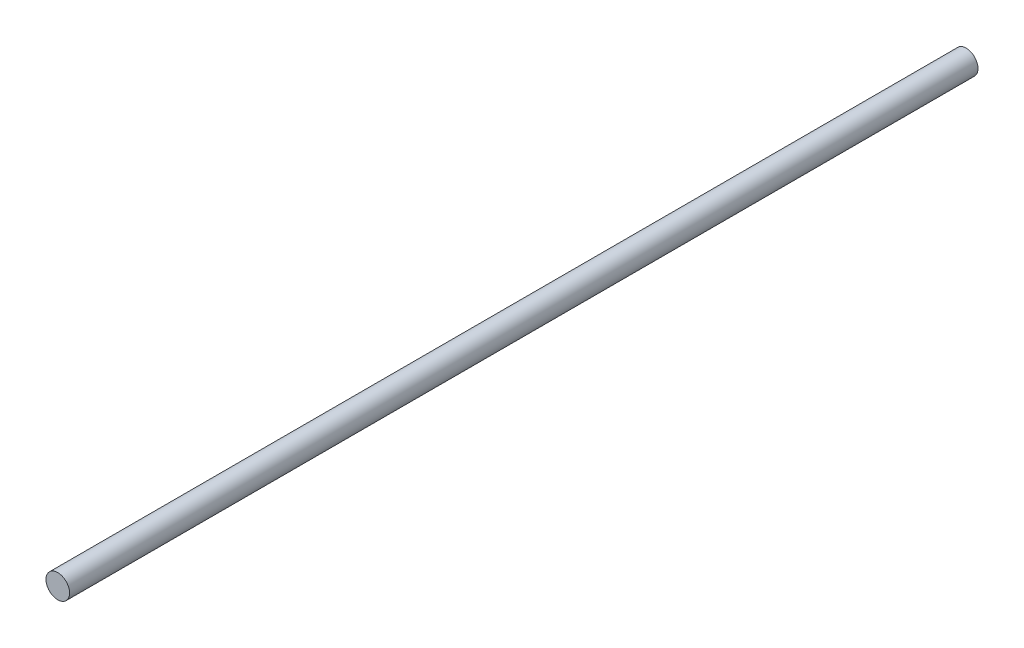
from build123d import *

# Parameters (mm, degrees)
CROQUIS1_R              = 5
SALIENTE_EXTRUIR1_DEPTH = 385


with BuildPart() as part:
    # Croquis1 → Saliente-Extruir1 (new body)
    with BuildSketch(Plane.XY):
        Circle(CROQUIS1_R)
    extrude(amount=SALIENTE_EXTRUIR1_DEPTH)


solid = part.part
